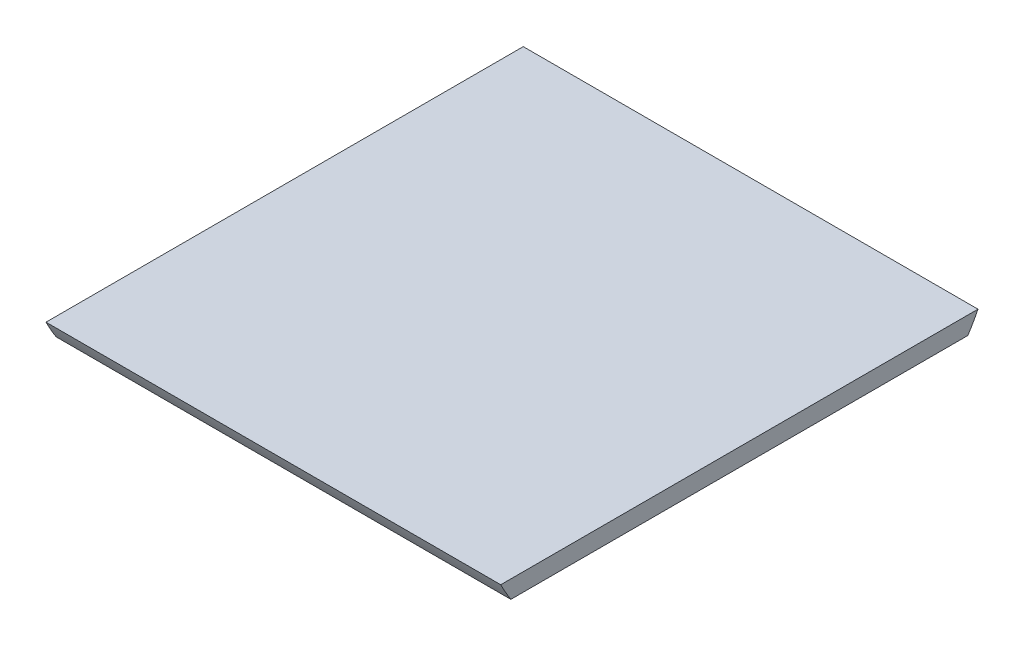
ISO-10303-21;
HEADER;
FILE_DESCRIPTION(('STEP AP214'),'2;1');
FILE_NAME('part.step','',(''),(''),'','','');
FILE_SCHEMA(('AUTOMOTIVE_DESIGN { 1 0 10303 214 1 1 1 1 }'));
ENDSEC;
DATA;
#1=APPLICATION_CONTEXT('core data for automotive mechanical design processes');
#2=APPLICATION_PROTOCOL_DEFINITION('international standard','automotive_design',2000,#1);
#3=PRODUCT_CONTEXT('',#1,'mechanical');
#4=PRODUCT('Part','Part','',(#3));
#5=PRODUCT_RELATED_PRODUCT_CATEGORY('part','',(#4));
#6=PRODUCT_DEFINITION_FORMATION('','',#4);
#7=PRODUCT_DEFINITION_CONTEXT('part definition',#1,'design');
#8=PRODUCT_DEFINITION('design','',#6,#7);
#9=PRODUCT_DEFINITION_SHAPE('','',#8);
#10=(LENGTH_UNIT() NAMED_UNIT(*) SI_UNIT(.MILLI.,.METRE.));
#11=(NAMED_UNIT(*) PLANE_ANGLE_UNIT() SI_UNIT($,.RADIAN.));
#12=(NAMED_UNIT(*) SI_UNIT($,.STERADIAN.) SOLID_ANGLE_UNIT());
#13=UNCERTAINTY_MEASURE_WITH_UNIT(LENGTH_MEASURE(1.E-05),#10,'distance_accuracy_value','');
#14=(GEOMETRIC_REPRESENTATION_CONTEXT(3) GLOBAL_UNCERTAINTY_ASSIGNED_CONTEXT((#13)) GLOBAL_UNIT_ASSIGNED_CONTEXT((#10,
#11,#12)) REPRESENTATION_CONTEXT('',''));
#15=CARTESIAN_POINT('',(0.,0.,0.));
#16=DIRECTION('',(0.,0.,1.));
#17=DIRECTION('',(1.,0.,0.));
#18=AXIS2_PLACEMENT_3D('',#15,#16,#17);
#19=CARTESIAN_POINT('',(1.54335610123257,-1.59999999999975,9.99892388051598));
#20=DIRECTION('',(0.,-1.,-1.03802971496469E-13));
#21=DIRECTION('',(0.,1.03802971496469E-13,-1.));
#22=AXIS2_PLACEMENT_3D('',#19,#20,#21);
#23=PLANE('',#22);
#24=DIRECTION('',(0.,-1.03802971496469E-13,1.));
#25=VECTOR('',#24,1.);
#26=CARTESIAN_POINT('',(-9.2848557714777,-1.59999999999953,9.24188982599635));
#27=LINE('',#26,#25);
#28=CARTESIAN_POINT('',(-9.2848557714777,-1.59999999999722,-12.120036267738));
#29=VERTEX_POINT('',#28);
#30=CARTESIAN_POINT('',(-9.2848557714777,-1.60000000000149,29.0897478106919));
#31=VERTEX_POINT('',#30);
#32=EDGE_CURVE('E76',#29,#31,#27,.T.);
#33=ORIENTED_EDGE('',*,*,#32,.F.);
#34=DIRECTION('',(1.,0.,0.));
#35=VECTOR('',#34,1.);
#36=CARTESIAN_POINT('',(-0.799999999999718,-1.59999999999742,-12.1200362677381));
#37=LINE('',#36,#35);
#38=CARTESIAN_POINT('',(31.7151442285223,-1.59999999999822,-12.1200362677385));
#39=VERTEX_POINT('',#38);
#40=EDGE_CURVE('E11',#29,#39,#37,.T.);
#41=ORIENTED_EDGE('',*,*,#40,.T.);
#42=DIRECTION('',(0.,-1.03802971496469E-13,1.));
#43=VECTOR('',#42,1.);
#44=CARTESIAN_POINT('',(31.7151442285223,-1.60000000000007,9.24188982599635));
#45=LINE('',#44,#43);
#46=CARTESIAN_POINT('',(31.7151442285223,-1.60000000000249,29.0897478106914));
#47=VERTEX_POINT('',#46);
#48=EDGE_CURVE('E27',#39,#47,#45,.T.);
#49=ORIENTED_EDGE('',*,*,#48,.T.);
#50=DIRECTION('',(-1.,0.,0.));
#51=VECTOR('',#50,1.);
#52=CARTESIAN_POINT('',(-0.79999999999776,-1.6000000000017,29.0897478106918));
#53=LINE('',#52,#51);
#54=EDGE_CURVE('E99',#47,#31,#53,.T.);
#55=ORIENTED_EDGE('',*,*,#54,.T.);
#56=EDGE_LOOP('',(#33,#41,#49,#55));
#57=FACE_BOUND('',#56,.T.);
#58=ADVANCED_FACE('F16',(#57),#23,.T.);
#59=CARTESIAN_POINT('',(-50.8,8.33666666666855,3.48485577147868));
#60=DIRECTION('',(-1.,0.,0.));
#61=DIRECTION('',(0.,0.,1.));
#62=AXIS2_PLACEMENT_3D('',#59,#60,#61);
#63=CYLINDRICAL_SURFACE('',#62,18.5);
#64=CARTESIAN_POINT('',(-9.28485577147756,8.33666666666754,3.48485577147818));
#65=DIRECTION('',(-1.,0.,0.));
#66=DIRECTION('',(0.,0.,1.));
#67=AXIS2_PLACEMENT_3D('',#64,#65,#66);
#68=CIRCLE('',#67,18.5);
#69=CARTESIAN_POINT('',(-9.2848557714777,2.84616774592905E-12,-13.030288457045));
#70=VERTEX_POINT('',#69);
#71=EDGE_CURVE('E86',#70,#29,#68,.T.);
#72=ORIENTED_EDGE('',*,*,#71,.F.);
#73=DIRECTION('',(-1.,0.,0.));
#74=VECTOR('',#73,1.);
#75=CARTESIAN_POINT('',(-0.799999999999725,2.63855604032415E-12,-13.0302884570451));
#76=LINE('',#75,#74);
#77=CARTESIAN_POINT('',(31.7151442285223,1.84274817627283E-12,-13.0302884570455));
#78=VERTEX_POINT('',#77);
#79=EDGE_CURVE('E81',#78,#70,#76,.T.);
#80=ORIENTED_EDGE('',*,*,#79,.F.);
#81=CARTESIAN_POINT('',(31.7151442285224,8.33666666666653,3.48485577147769));
#82=DIRECTION('',(-1.,0.,0.));
#83=DIRECTION('',(0.,0.,1.));
#84=AXIS2_PLACEMENT_3D('',#81,#82,#83);
#85=CIRCLE('',#84,18.5);
#86=EDGE_CURVE('E104',#78,#39,#85,.T.);
#87=ORIENTED_EDGE('',*,*,#86,.T.);
#88=ORIENTED_EDGE('',*,*,#40,.F.);
#89=EDGE_LOOP('',(#72,#80,#87,#88));
#90=FACE_BOUND('',#89,.T.);
#91=ADVANCED_FACE('F121',(#90),#63,.T.);
#92=CARTESIAN_POINT('',(31.7151442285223,0.,8.48485577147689));
#93=DIRECTION('',(1.,0.,0.));
#94=DIRECTION('',(0.,0.,1.));
#95=AXIS2_PLACEMENT_3D('',#92,#93,#94);
#96=PLANE('',#95);
#97=ORIENTED_EDGE('',*,*,#86,.F.);
#98=DIRECTION('',(0.,1.03801302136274E-13,-1.));
#99=VECTOR('',#98,1.);
#100=CARTESIAN_POINT('',(31.7151442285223,0.,9.24188982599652));
#101=LINE('',#100,#99);
#102=CARTESIAN_POINT('',(31.7151442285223,-2.62123656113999E-12,29.9999999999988));
#103=VERTEX_POINT('',#102);
#104=EDGE_CURVE('E75',#103,#78,#101,.T.);
#105=ORIENTED_EDGE('',*,*,#104,.F.);
#106=CARTESIAN_POINT('',(31.7151442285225,8.33666666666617,13.4848557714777));
#107=DIRECTION('',(-1.,0.,0.));
#108=DIRECTION('',(0.,0.,-1.));
#109=AXIS2_PLACEMENT_3D('',#106,#107,#108);
#110=CIRCLE('',#109,18.5);
#111=EDGE_CURVE('E70',#47,#103,#110,.T.);
#112=ORIENTED_EDGE('',*,*,#111,.F.);
#113=ORIENTED_EDGE('',*,*,#48,.F.);
#114=EDGE_LOOP('',(#97,#105,#112,#113));
#115=FACE_BOUND('',#114,.T.);
#116=ADVANCED_FACE('F116',(#115),#96,.T.);
#117=CARTESIAN_POINT('',(-50.8,8.33666666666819,13.4848557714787));
#118=DIRECTION('',(1.,0.,0.));
#119=DIRECTION('',(0.,0.,-1.));
#120=AXIS2_PLACEMENT_3D('',#117,#118,#119);
#121=CYLINDRICAL_SURFACE('',#120,18.5);
#122=CARTESIAN_POINT('',(-9.28485577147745,8.33666666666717,13.4848557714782));
#123=DIRECTION('',(-1.,0.,0.));
#124=DIRECTION('',(0.,0.,-1.));
#125=AXIS2_PLACEMENT_3D('',#122,#123,#124);
#126=CIRCLE('',#125,18.5);
#127=CARTESIAN_POINT('',(-9.2848557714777,-1.61781699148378E-12,29.9999999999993));
#128=VERTEX_POINT('',#127);
#129=EDGE_CURVE('E68',#31,#128,#126,.T.);
#130=ORIENTED_EDGE('',*,*,#129,.F.);
#131=ORIENTED_EDGE('',*,*,#54,.F.);
#132=ORIENTED_EDGE('',*,*,#111,.T.);
#133=DIRECTION('',(1.,0.,0.));
#134=VECTOR('',#133,1.);
#135=CARTESIAN_POINT('',(-0.799999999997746,-1.82542869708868E-12,29.9999999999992));
#136=LINE('',#135,#134);
#137=EDGE_CURVE('E20',#128,#103,#136,.T.);
#138=ORIENTED_EDGE('',*,*,#137,.F.);
#139=EDGE_LOOP('',(#130,#131,#132,#138));
#140=FACE_BOUND('',#139,.T.);
#141=ADVANCED_FACE('F65',(#140),#121,.T.);
#142=CARTESIAN_POINT('',(1.54335610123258,2.19158025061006E-13,9.99892388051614));
#143=DIRECTION('',(0.,-1.,-1.03801302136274E-13));
#144=DIRECTION('',(0.,1.03801302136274E-13,-1.));
#145=AXIS2_PLACEMENT_3D('',#142,#143,#144);
#146=PLANE('',#145);
#147=DIRECTION('',(0.,1.03801302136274E-13,-1.));
#148=VECTOR('',#147,1.);
#149=CARTESIAN_POINT('',(-9.2848557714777,4.40536496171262E-13,9.24188982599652));
#150=LINE('',#149,#148);
#151=EDGE_CURVE('E78',#128,#70,#150,.T.);
#152=ORIENTED_EDGE('',*,*,#151,.F.);
#153=ORIENTED_EDGE('',*,*,#137,.T.);
#154=ORIENTED_EDGE('',*,*,#104,.T.);
#155=ORIENTED_EDGE('',*,*,#79,.T.);
#156=EDGE_LOOP('',(#152,#153,#154,#155));
#157=FACE_BOUND('',#156,.T.);
#158=ADVANCED_FACE('F79',(#157),#146,.F.);
#159=CARTESIAN_POINT('',(-9.2848557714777,0.,8.48485577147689));
#160=DIRECTION('',(1.,0.,0.));
#161=DIRECTION('',(0.,0.,1.));
#162=AXIS2_PLACEMENT_3D('',#159,#160,#161);
#163=PLANE('',#162);
#164=ORIENTED_EDGE('',*,*,#129,.T.);
#165=ORIENTED_EDGE('',*,*,#151,.T.);
#166=ORIENTED_EDGE('',*,*,#71,.T.);
#167=ORIENTED_EDGE('',*,*,#32,.T.);
#168=EDGE_LOOP('',(#164,#165,#166,#167));
#169=FACE_BOUND('',#168,.T.);
#170=ADVANCED_FACE('F18',(#169),#163,.F.);
#171=CLOSED_SHELL('',(#58,#91,#116,#141,#158,#170));
#172=MANIFOLD_SOLID_BREP('B1',#171);
#173=ADVANCED_BREP_SHAPE_REPRESENTATION('',(#18,#172),#14);
#174=SHAPE_DEFINITION_REPRESENTATION(#9,#173);
ENDSEC;
END-ISO-10303-21;
